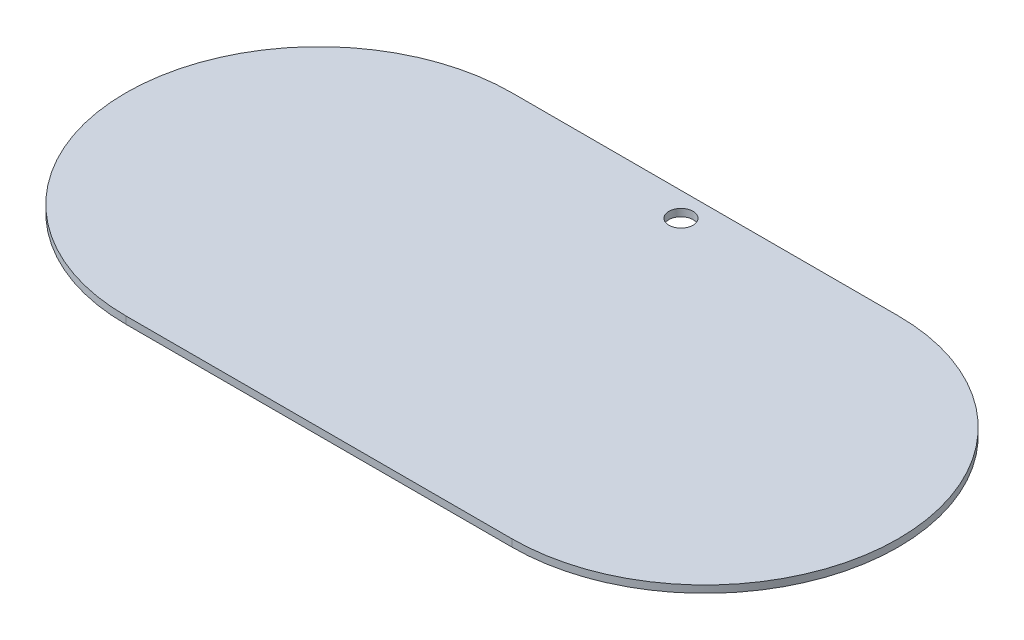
ISO-10303-21;
HEADER;
FILE_DESCRIPTION(('STEP AP214'),'2;1');
FILE_NAME('part.step','',(''),(''),'','','');
FILE_SCHEMA(('AUTOMOTIVE_DESIGN { 1 0 10303 214 1 1 1 1 }'));
ENDSEC;
DATA;
#1=APPLICATION_CONTEXT('core data for automotive mechanical design processes');
#2=APPLICATION_PROTOCOL_DEFINITION('international standard','automotive_design',2000,#1);
#3=PRODUCT_CONTEXT('',#1,'mechanical');
#4=PRODUCT('Part','Part','',(#3));
#5=PRODUCT_RELATED_PRODUCT_CATEGORY('part','',(#4));
#6=PRODUCT_DEFINITION_FORMATION('','',#4);
#7=PRODUCT_DEFINITION_CONTEXT('part definition',#1,'design');
#8=PRODUCT_DEFINITION('design','',#6,#7);
#9=PRODUCT_DEFINITION_SHAPE('','',#8);
#10=(LENGTH_UNIT() NAMED_UNIT(*) SI_UNIT(.MILLI.,.METRE.));
#11=(NAMED_UNIT(*) PLANE_ANGLE_UNIT() SI_UNIT($,.RADIAN.));
#12=(NAMED_UNIT(*) SI_UNIT($,.STERADIAN.) SOLID_ANGLE_UNIT());
#13=UNCERTAINTY_MEASURE_WITH_UNIT(LENGTH_MEASURE(1.E-05),#10,'distance_accuracy_value','');
#14=(GEOMETRIC_REPRESENTATION_CONTEXT(3) GLOBAL_UNCERTAINTY_ASSIGNED_CONTEXT((#13)) GLOBAL_UNIT_ASSIGNED_CONTEXT((#10,
#11,#12)) REPRESENTATION_CONTEXT('',''));
#15=CARTESIAN_POINT('',(0.,0.,0.));
#16=DIRECTION('',(0.,0.,1.));
#17=DIRECTION('',(1.,0.,0.));
#18=AXIS2_PLACEMENT_3D('',#15,#16,#17);
#19=CARTESIAN_POINT('',(-50.8,-1.905,0.));
#20=DIRECTION('',(0.,1.,0.));
#21=DIRECTION('',(0.,0.,1.));
#22=AXIS2_PLACEMENT_3D('',#19,#20,#21);
#23=CYLINDRICAL_SURFACE('',#22,50.8);
#24=CARTESIAN_POINT('',(-50.8,0.,0.));
#25=DIRECTION('',(0.,1.,0.));
#26=DIRECTION('',(0.,0.,1.));
#27=AXIS2_PLACEMENT_3D('',#24,#25,#26);
#28=CIRCLE('',#27,50.8);
#29=CARTESIAN_POINT('',(-50.8,0.,-50.8));
#30=VERTEX_POINT('',#29);
#31=CARTESIAN_POINT('',(-50.8,0.,50.8));
#32=VERTEX_POINT('',#31);
#33=EDGE_CURVE('E104',#30,#32,#28,.T.);
#34=ORIENTED_EDGE('',*,*,#33,.F.);
#35=DIRECTION('',(0.,1.,0.));
#36=VECTOR('',#35,1.);
#37=CARTESIAN_POINT('',(-50.8,-1.905,-50.8));
#38=LINE('',#37,#36);
#39=CARTESIAN_POINT('',(-50.8,-1.905,-50.8));
#40=VERTEX_POINT('',#39);
#41=EDGE_CURVE('E11',#40,#30,#38,.T.);
#42=ORIENTED_EDGE('',*,*,#41,.F.);
#43=CARTESIAN_POINT('',(-50.8,-1.905,0.));
#44=DIRECTION('',(0.,1.,0.));
#45=DIRECTION('',(0.,0.,1.));
#46=AXIS2_PLACEMENT_3D('',#43,#44,#45);
#47=CIRCLE('',#46,50.8);
#48=CARTESIAN_POINT('',(-50.8,-1.905,50.8));
#49=VERTEX_POINT('',#48);
#50=EDGE_CURVE('E97',#40,#49,#47,.T.);
#51=ORIENTED_EDGE('',*,*,#50,.T.);
#52=DIRECTION('',(0.,1.,0.));
#53=VECTOR('',#52,1.);
#54=CARTESIAN_POINT('',(-50.8,-1.905,50.8));
#55=LINE('',#54,#53);
#56=EDGE_CURVE('E80',#49,#32,#55,.T.);
#57=ORIENTED_EDGE('',*,*,#56,.T.);
#58=EDGE_LOOP('',(#34,#42,#51,#57));
#59=FACE_BOUND('',#58,.T.);
#60=ADVANCED_FACE('F37',(#59),#23,.T.);
#61=CARTESIAN_POINT('',(-50.8,-1.905,-50.8));
#62=DIRECTION('',(0.,0.,-1.));
#63=DIRECTION('',(-1.,0.,0.));
#64=AXIS2_PLACEMENT_3D('',#61,#62,#63);
#65=PLANE('',#64);
#66=DIRECTION('',(-1.,0.,0.));
#67=VECTOR('',#66,1.);
#68=CARTESIAN_POINT('',(-50.8,0.,-50.8));
#69=LINE('',#68,#67);
#70=CARTESIAN_POINT('',(50.8,0.,-50.8));
#71=VERTEX_POINT('',#70);
#72=EDGE_CURVE('E99',#71,#30,#69,.T.);
#73=ORIENTED_EDGE('',*,*,#72,.F.);
#74=DIRECTION('',(0.,1.,0.));
#75=VECTOR('',#74,1.);
#76=CARTESIAN_POINT('',(50.8,-1.905,-50.8));
#77=LINE('',#76,#75);
#78=CARTESIAN_POINT('',(50.8,-1.905,-50.8));
#79=VERTEX_POINT('',#78);
#80=EDGE_CURVE('E46',#79,#71,#77,.T.);
#81=ORIENTED_EDGE('',*,*,#80,.F.);
#82=DIRECTION('',(-1.,0.,0.));
#83=VECTOR('',#82,1.);
#84=CARTESIAN_POINT('',(-50.8,-1.905,-50.8));
#85=LINE('',#84,#83);
#86=EDGE_CURVE('E94',#79,#40,#85,.T.);
#87=ORIENTED_EDGE('',*,*,#86,.T.);
#88=ORIENTED_EDGE('',*,*,#41,.T.);
#89=EDGE_LOOP('',(#73,#81,#87,#88));
#90=FACE_BOUND('',#89,.T.);
#91=ADVANCED_FACE('F114',(#90),#65,.T.);
#92=CARTESIAN_POINT('',(50.8,-1.905,0.));
#93=DIRECTION('',(0.,1.,0.));
#94=DIRECTION('',(0.,0.,1.));
#95=AXIS2_PLACEMENT_3D('',#92,#93,#94);
#96=CYLINDRICAL_SURFACE('',#95,50.8);
#97=CARTESIAN_POINT('',(50.8,0.,0.));
#98=DIRECTION('',(0.,1.,0.));
#99=DIRECTION('',(0.,0.,1.));
#100=AXIS2_PLACEMENT_3D('',#97,#98,#99);
#101=CIRCLE('',#100,50.8);
#102=CARTESIAN_POINT('',(50.8,0.,50.8));
#103=VERTEX_POINT('',#102);
#104=EDGE_CURVE('E88',#103,#71,#101,.T.);
#105=ORIENTED_EDGE('',*,*,#104,.F.);
#106=DIRECTION('',(0.,1.,0.));
#107=VECTOR('',#106,1.);
#108=CARTESIAN_POINT('',(50.8,-1.905,50.8));
#109=LINE('',#108,#107);
#110=CARTESIAN_POINT('',(50.8,-1.905,50.8));
#111=VERTEX_POINT('',#110);
#112=EDGE_CURVE('E83',#111,#103,#109,.T.);
#113=ORIENTED_EDGE('',*,*,#112,.F.);
#114=CARTESIAN_POINT('',(50.8,-1.905,0.));
#115=DIRECTION('',(0.,1.,0.));
#116=DIRECTION('',(0.,0.,1.));
#117=AXIS2_PLACEMENT_3D('',#114,#115,#116);
#118=CIRCLE('',#117,50.8);
#119=EDGE_CURVE('E86',#111,#79,#118,.T.);
#120=ORIENTED_EDGE('',*,*,#119,.T.);
#121=ORIENTED_EDGE('',*,*,#80,.T.);
#122=EDGE_LOOP('',(#105,#113,#120,#121));
#123=FACE_BOUND('',#122,.T.);
#124=ADVANCED_FACE('F85',(#123),#96,.T.);
#125=CARTESIAN_POINT('',(-50.8,-1.905,50.8));
#126=DIRECTION('',(0.,0.,1.));
#127=DIRECTION('',(1.,0.,0.));
#128=AXIS2_PLACEMENT_3D('',#125,#126,#127);
#129=PLANE('',#128);
#130=DIRECTION('',(1.,0.,0.));
#131=VECTOR('',#130,1.);
#132=CARTESIAN_POINT('',(-50.8,0.,50.8));
#133=LINE('',#132,#131);
#134=EDGE_CURVE('E107',#32,#103,#133,.T.);
#135=ORIENTED_EDGE('',*,*,#134,.F.);
#136=ORIENTED_EDGE('',*,*,#56,.F.);
#137=DIRECTION('',(1.,0.,0.));
#138=VECTOR('',#137,1.);
#139=CARTESIAN_POINT('',(-50.8,-1.905,50.8));
#140=LINE('',#139,#138);
#141=EDGE_CURVE('E93',#49,#111,#140,.T.);
#142=ORIENTED_EDGE('',*,*,#141,.T.);
#143=ORIENTED_EDGE('',*,*,#112,.T.);
#144=EDGE_LOOP('',(#135,#136,#142,#143));
#145=FACE_BOUND('',#144,.T.);
#146=ADVANCED_FACE('F96',(#145),#129,.T.);
#147=CARTESIAN_POINT('',(-50.8,-1.905,0.));
#148=DIRECTION('',(0.,1.,0.));
#149=DIRECTION('',(0.,0.,1.));
#150=AXIS2_PLACEMENT_3D('',#147,#148,#149);
#151=PLANE('',#150);
#152=CARTESIAN_POINT('',(0.,-1.905,-44.45));
#153=DIRECTION('',(0.,1.,0.));
#154=DIRECTION('',(0.,0.,1.));
#155=AXIS2_PLACEMENT_3D('',#152,#153,#154);
#156=CIRCLE('',#155,3.175);
#157=CARTESIAN_POINT('',(0.,-1.905,-41.275));
#158=VERTEX_POINT('',#157);
#159=EDGE_CURVE('E144',#158,#158,#156,.T.);
#160=ORIENTED_EDGE('',*,*,#159,.T.);
#161=EDGE_LOOP('',(#160));
#162=FACE_BOUND('',#161,.T.);
#163=ORIENTED_EDGE('',*,*,#50,.F.);
#164=ORIENTED_EDGE('',*,*,#86,.F.);
#165=ORIENTED_EDGE('',*,*,#119,.F.);
#166=ORIENTED_EDGE('',*,*,#141,.F.);
#167=EDGE_LOOP('',(#163,#164,#165,#166));
#168=FACE_BOUND('',#167,.T.);
#169=ADVANCED_FACE('F92',(#162,#168),#151,.F.);
#170=CARTESIAN_POINT('',(-50.8,0.,0.));
#171=DIRECTION('',(0.,1.,0.));
#172=DIRECTION('',(0.,0.,1.));
#173=AXIS2_PLACEMENT_3D('',#170,#171,#172);
#174=PLANE('',#173);
#175=CARTESIAN_POINT('',(0.,0.,-44.45));
#176=DIRECTION('',(0.,1.,0.));
#177=DIRECTION('',(0.,0.,1.));
#178=AXIS2_PLACEMENT_3D('',#175,#176,#177);
#179=CIRCLE('',#178,3.175);
#180=CARTESIAN_POINT('',(0.,0.,-41.275));
#181=VERTEX_POINT('',#180);
#182=EDGE_CURVE('E40',#181,#181,#179,.T.);
#183=ORIENTED_EDGE('',*,*,#182,.F.);
#184=EDGE_LOOP('',(#183));
#185=FACE_BOUND('',#184,.T.);
#186=ORIENTED_EDGE('',*,*,#33,.T.);
#187=ORIENTED_EDGE('',*,*,#134,.T.);
#188=ORIENTED_EDGE('',*,*,#104,.T.);
#189=ORIENTED_EDGE('',*,*,#72,.T.);
#190=EDGE_LOOP('',(#186,#187,#188,#189));
#191=FACE_BOUND('',#190,.T.);
#192=ADVANCED_FACE('F113',(#185,#191),#174,.T.);
#193=CARTESIAN_POINT('',(0.,-1.905,-44.45));
#194=DIRECTION('',(0.,1.,0.));
#195=DIRECTION('',(0.,0.,1.));
#196=AXIS2_PLACEMENT_3D('',#193,#194,#195);
#197=CYLINDRICAL_SURFACE('',#196,3.175);
#198=CARTESIAN_POINT('',(0.,0.,-41.275));
#199=CARTESIAN_POINT('',(0.,-0.01984375,-41.275));
#200=CARTESIAN_POINT('',(0.,-0.0396874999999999,-41.275));
#201=CARTESIAN_POINT('',(0.,-0.0793749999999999,-41.275));
#202=CARTESIAN_POINT('',(0.,-0.09921875,-41.275));
#203=CARTESIAN_POINT('',(0.,-0.13890625,-41.275));
#204=CARTESIAN_POINT('',(0.,-0.15875,-41.275));
#205=CARTESIAN_POINT('',(0.,-0.1984375,-41.275));
#206=CARTESIAN_POINT('',(0.,-0.21828125,-41.275));
#207=CARTESIAN_POINT('',(0.,-0.25796875,-41.275));
#208=CARTESIAN_POINT('',(0.,-0.2778125,-41.275));
#209=CARTESIAN_POINT('',(0.,-0.3175,-41.275));
#210=CARTESIAN_POINT('',(0.,-0.33734375,-41.275));
#211=CARTESIAN_POINT('',(0.,-0.37703125,-41.275));
#212=CARTESIAN_POINT('',(0.,-0.396875,-41.275));
#213=CARTESIAN_POINT('',(0.,-0.4365625,-41.275));
#214=CARTESIAN_POINT('',(0.,-0.45640625,-41.275));
#215=CARTESIAN_POINT('',(0.,-0.49609375,-41.275));
#216=CARTESIAN_POINT('',(0.,-0.5159375,-41.275));
#217=CARTESIAN_POINT('',(0.,-0.555625,-41.275));
#218=CARTESIAN_POINT('',(0.,-0.57546875,-41.275));
#219=CARTESIAN_POINT('',(0.,-0.61515625,-41.275));
#220=CARTESIAN_POINT('',(0.,-0.635,-41.275));
#221=CARTESIAN_POINT('',(0.,-0.6746875,-41.275));
#222=CARTESIAN_POINT('',(0.,-0.69453125,-41.275));
#223=CARTESIAN_POINT('',(0.,-0.73421875,-41.275));
#224=CARTESIAN_POINT('',(0.,-0.7540625,-41.275));
#225=CARTESIAN_POINT('',(0.,-0.79375,-41.275));
#226=CARTESIAN_POINT('',(0.,-0.81359375,-41.275));
#227=CARTESIAN_POINT('',(0.,-0.85328125,-41.275));
#228=CARTESIAN_POINT('',(0.,-0.873125,-41.275));
#229=CARTESIAN_POINT('',(0.,-0.9128125,-41.275));
#230=CARTESIAN_POINT('',(0.,-0.93265625,-41.275));
#231=CARTESIAN_POINT('',(0.,-0.97234375,-41.275));
#232=CARTESIAN_POINT('',(0.,-0.9921875,-41.275));
#233=CARTESIAN_POINT('',(0.,-1.031875,-41.275));
#234=CARTESIAN_POINT('',(0.,-1.05171875,-41.275));
#235=CARTESIAN_POINT('',(0.,-1.09140625,-41.275));
#236=CARTESIAN_POINT('',(0.,-1.11125,-41.275));
#237=CARTESIAN_POINT('',(0.,-1.1509375,-41.275));
#238=CARTESIAN_POINT('',(0.,-1.17078125,-41.275));
#239=CARTESIAN_POINT('',(0.,-1.21046875,-41.275));
#240=CARTESIAN_POINT('',(0.,-1.2303125,-41.275));
#241=CARTESIAN_POINT('',(0.,-1.27,-41.275));
#242=CARTESIAN_POINT('',(0.,-1.28984375,-41.275));
#243=CARTESIAN_POINT('',(0.,-1.32953125,-41.275));
#244=CARTESIAN_POINT('',(0.,-1.349375,-41.275));
#245=CARTESIAN_POINT('',(0.,-1.3890625,-41.275));
#246=CARTESIAN_POINT('',(0.,-1.40890625,-41.275));
#247=CARTESIAN_POINT('',(0.,-1.44859375,-41.275));
#248=CARTESIAN_POINT('',(0.,-1.4684375,-41.275));
#249=CARTESIAN_POINT('',(0.,-1.508125,-41.275));
#250=CARTESIAN_POINT('',(0.,-1.52796875,-41.275));
#251=CARTESIAN_POINT('',(0.,-1.56765625,-41.275));
#252=CARTESIAN_POINT('',(0.,-1.5875,-41.275));
#253=CARTESIAN_POINT('',(0.,-1.6271875,-41.275));
#254=CARTESIAN_POINT('',(0.,-1.64703125,-41.275));
#255=CARTESIAN_POINT('',(0.,-1.68671875,-41.275));
#256=CARTESIAN_POINT('',(0.,-1.7065625,-41.275));
#257=CARTESIAN_POINT('',(0.,-1.74625,-41.275));
#258=CARTESIAN_POINT('',(0.,-1.76609375,-41.275));
#259=CARTESIAN_POINT('',(0.,-1.80578125,-41.275));
#260=CARTESIAN_POINT('',(0.,-1.825625,-41.275));
#261=CARTESIAN_POINT('',(0.,-1.8653125,-41.275));
#262=CARTESIAN_POINT('',(0.,-1.88515625,-41.275));
#263=CARTESIAN_POINT('',(0.,-1.905,-41.275));
#264=B_SPLINE_CURVE_WITH_KNOTS('',3,(#198,#199,#200,#201,#202,#203,#204,#205,#206,#207,#208,
#209,#210,#211,#212,#213,#214,#215,#216,#217,#218,#219,#220,#221,#222,#223,#224,#225,#226,#227,
#228,#229,#230,#231,#232,#233,#234,#235,#236,#237,#238,#239,#240,#241,#242,#243,#244,#245,#246,
#247,#248,#249,#250,#251,#252,#253,#254,#255,#256,#257,#258,#259,#260,#261,#262,#263),
.UNSPECIFIED.,.F.,.F.,(4,2,2,2,2,2,2,2,2,2,2,2,2,2,2,2,2,2,2,2,2,2,2,2,2,2,2,2,2,2,2,2,4),(0.,
0.0595312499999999,0.1190625,0.17859375,0.238125,0.29765625,0.3571875,0.41671875,0.47625,
0.53578125,0.5953125,0.65484375,0.714375,0.77390625,0.8334375,0.89296875,0.9525,1.01203125,
1.0715625,1.13109375,1.190625,1.25015625,1.3096875,1.36921875,1.42875,1.48828125,1.5478125,
1.60734375,1.666875,1.72640625,1.7859375,1.84546875,1.905),.UNSPECIFIED.);
#265=EDGE_CURVE('BSEAM132',#181,#158,#264,.T.);
#266=ORIENTED_EDGE('',*,*,#182,.T.);
#267=ORIENTED_EDGE('',*,*,#159,.F.);
#268=ORIENTED_EDGE('',*,*,#265,.T.);
#269=ORIENTED_EDGE('',*,*,#265,.F.);
#270=EDGE_LOOP('',(#266,#268,#267,#269));
#271=FACE_BOUND('',#270,.T.);
#272=ADVANCED_FACE('F132',(#271),#197,.F.);
#273=CLOSED_SHELL('',(#60,#91,#124,#146,#169,#192,#272));
#274=MANIFOLD_SOLID_BREP('B2',#273);
#275=ADVANCED_BREP_SHAPE_REPRESENTATION('',(#18,#274),#14);
#276=SHAPE_DEFINITION_REPRESENTATION(#9,#275);
ENDSEC;
END-ISO-10303-21;
